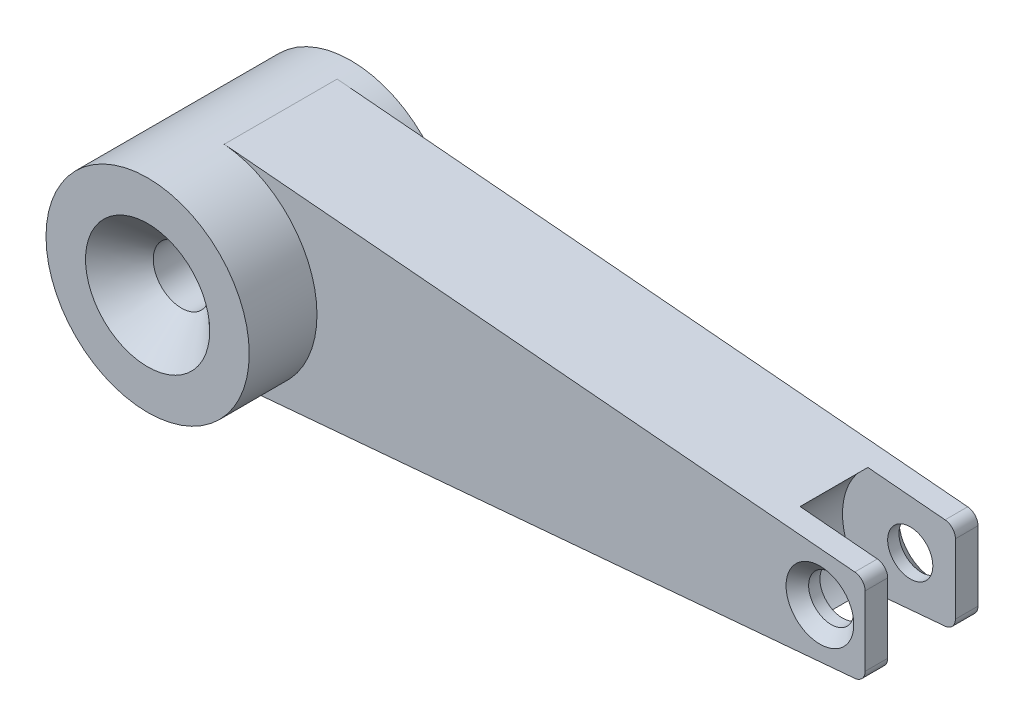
ISO-10303-21;
HEADER;
FILE_DESCRIPTION(('STEP AP214'),'2;1');
FILE_NAME('part.step','',(''),(''),'','','');
FILE_SCHEMA(('AUTOMOTIVE_DESIGN { 1 0 10303 214 1 1 1 1 }'));
ENDSEC;
DATA;
#1=APPLICATION_CONTEXT('core data for automotive mechanical design processes');
#2=APPLICATION_PROTOCOL_DEFINITION('international standard','automotive_design',2000,#1);
#3=PRODUCT_CONTEXT('',#1,'mechanical');
#4=PRODUCT('Part','Part','',(#3));
#5=PRODUCT_RELATED_PRODUCT_CATEGORY('part','',(#4));
#6=PRODUCT_DEFINITION_FORMATION('','',#4);
#7=PRODUCT_DEFINITION_CONTEXT('part definition',#1,'design');
#8=PRODUCT_DEFINITION('design','',#6,#7);
#9=PRODUCT_DEFINITION_SHAPE('','',#8);
#10=(LENGTH_UNIT() NAMED_UNIT(*) SI_UNIT(.MILLI.,.METRE.));
#11=(NAMED_UNIT(*) PLANE_ANGLE_UNIT() SI_UNIT($,.RADIAN.));
#12=(NAMED_UNIT(*) SI_UNIT($,.STERADIAN.) SOLID_ANGLE_UNIT());
#13=UNCERTAINTY_MEASURE_WITH_UNIT(LENGTH_MEASURE(1.E-05),#10,'distance_accuracy_value','');
#14=(GEOMETRIC_REPRESENTATION_CONTEXT(3) GLOBAL_UNCERTAINTY_ASSIGNED_CONTEXT((#13)) GLOBAL_UNIT_ASSIGNED_CONTEXT((#10,
#11,#12)) REPRESENTATION_CONTEXT('',''));
#15=CARTESIAN_POINT('',(0.,0.,0.));
#16=DIRECTION('',(0.,0.,1.));
#17=DIRECTION('',(1.,0.,0.));
#18=AXIS2_PLACEMENT_3D('',#15,#16,#17);
#19=CARTESIAN_POINT('',(57.5432099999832,4.,12.));
#20=DIRECTION('',(-1.,0.,0.));
#21=DIRECTION('',(0.,0.,1.));
#22=AXIS2_PLACEMENT_3D('',#19,#20,#21);
#23=PLANE('',#22);
#24=DIRECTION('',(0.,1.,0.));
#25=VECTOR('',#24,1.);
#26=CARTESIAN_POINT('',(57.5432099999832,4.,4.));
#27=LINE('',#26,#25);
#28=CARTESIAN_POINT('',(57.5432099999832,-3.08366882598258,4.));
#29=VERTEX_POINT('',#28);
#30=CARTESIAN_POINT('',(57.5432099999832,3.08366882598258,4.));
#31=VERTEX_POINT('',#30);
#32=EDGE_CURVE('E305',#29,#31,#27,.T.);
#33=ORIENTED_EDGE('',*,*,#32,.F.);
#34=DIRECTION('',(0.,0.,-1.));
#35=VECTOR('',#34,1.);
#36=CARTESIAN_POINT('',(57.5432099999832,-3.08366882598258,12.));
#37=LINE('',#36,#35);
#38=CARTESIAN_POINT('',(57.5432099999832,-3.08366882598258,2.));
#39=VERTEX_POINT('',#38);
#40=EDGE_CURVE('E175',#29,#39,#37,.T.);
#41=ORIENTED_EDGE('',*,*,#40,.T.);
#42=DIRECTION('',(0.,-1.,0.));
#43=VECTOR('',#42,1.);
#44=CARTESIAN_POINT('',(57.5432099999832,4.,2.));
#45=LINE('',#44,#43);
#46=CARTESIAN_POINT('',(57.5432099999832,3.08366882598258,2.));
#47=VERTEX_POINT('',#46);
#48=EDGE_CURVE('E271',#47,#39,#45,.T.);
#49=ORIENTED_EDGE('',*,*,#48,.F.);
#50=DIRECTION('',(0.,0.,-1.));
#51=VECTOR('',#50,1.);
#52=CARTESIAN_POINT('',(57.5432099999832,3.08366882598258,12.));
#53=LINE('',#52,#51);
#54=EDGE_CURVE('E173',#47,#31,#53,.F.);
#55=ORIENTED_EDGE('',*,*,#54,.T.);
#56=EDGE_LOOP('',(#33,#41,#49,#55));
#57=FACE_BOUND('',#56,.T.);
#58=ADVANCED_FACE('F35',(#57),#23,.F.);
#59=CARTESIAN_POINT('',(57.5432099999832,-4.,12.));
#60=DIRECTION('',(-0.0871557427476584,0.996194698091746,0.));
#61=DIRECTION('',(-0.996194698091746,-0.0871557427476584,0.));
#62=AXIS2_PLACEMENT_3D('',#59,#60,#61);
#63=PLANE('',#62);
#64=DIRECTION('',(-0.996194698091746,-0.0871557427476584,0.));
#65=VECTOR('',#64,1.);
#66=CARTESIAN_POINT('',(57.5432099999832,-4.,2.));
#67=LINE('',#66,#65);
#68=CARTESIAN_POINT('',(56.6303657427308,-4.07986352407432,2.));
#69=VERTEX_POINT('',#68);
#70=CARTESIAN_POINT('',(0.784401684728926,-8.96575228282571,2.));
#71=VERTEX_POINT('',#70);
#72=EDGE_CURVE('E274',#69,#71,#67,.T.);
#73=ORIENTED_EDGE('',*,*,#72,.F.);
#74=DIRECTION('',(0.,0.,-1.));
#75=VECTOR('',#74,1.);
#76=CARTESIAN_POINT('',(56.6303657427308,-4.07986352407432,12.));
#77=LINE('',#76,#75);
#78=CARTESIAN_POINT('',(56.6303657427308,-4.07986352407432,4.));
#79=VERTEX_POINT('',#78);
#80=EDGE_CURVE('E184',#69,#79,#77,.F.);
#81=ORIENTED_EDGE('',*,*,#80,.T.);
#82=DIRECTION('',(0.996194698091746,0.0871557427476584,0.));
#83=VECTOR('',#82,1.);
#84=CARTESIAN_POINT('',(57.5432099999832,-4.,4.));
#85=LINE('',#84,#83);
#86=CARTESIAN_POINT('',(49.7867873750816,-4.67859904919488,4.));
#87=VERTEX_POINT('',#86);
#88=EDGE_CURVE('E263',#87,#79,#85,.T.);
#89=ORIENTED_EDGE('',*,*,#88,.F.);
#90=DIRECTION('',(0.,0.,-1.));
#91=VECTOR('',#90,1.);
#92=CARTESIAN_POINT('',(49.7867873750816,-4.67859904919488,10.));
#93=LINE('',#92,#91);
#94=CARTESIAN_POINT('',(49.7867873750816,-4.67859904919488,10.));
#95=VERTEX_POINT('',#94);
#96=EDGE_CURVE('E149',#95,#87,#93,.T.);
#97=ORIENTED_EDGE('',*,*,#96,.F.);
#98=DIRECTION('',(0.996194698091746,0.0871557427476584,0.));
#99=VECTOR('',#98,1.);
#100=CARTESIAN_POINT('',(57.5432099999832,-4.,10.));
#101=LINE('',#100,#99);
#102=CARTESIAN_POINT('',(56.6303657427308,-4.07986352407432,10.));
#103=VERTEX_POINT('',#102);
#104=EDGE_CURVE('E256',#95,#103,#101,.T.);
#105=ORIENTED_EDGE('',*,*,#104,.T.);
#106=DIRECTION('',(0.,0.,-1.));
#107=VECTOR('',#106,1.);
#108=CARTESIAN_POINT('',(56.6303657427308,-4.07986352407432,12.));
#109=LINE('',#108,#107);
#110=CARTESIAN_POINT('',(56.6303657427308,-4.07986352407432,12.));
#111=VERTEX_POINT('',#110);
#112=EDGE_CURVE('E182',#103,#111,#109,.F.);
#113=ORIENTED_EDGE('',*,*,#112,.T.);
#114=DIRECTION('',(0.996194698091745,0.0871557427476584,0.));
#115=VECTOR('',#114,1.);
#116=CARTESIAN_POINT('',(57.5432099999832,-4.,12.));
#117=LINE('',#116,#115);
#118=CARTESIAN_POINT('',(0.784401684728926,-8.96575228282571,12.));
#119=VERTEX_POINT('',#118);
#120=EDGE_CURVE('E248',#119,#111,#117,.T.);
#121=ORIENTED_EDGE('',*,*,#120,.F.);
#122=DIRECTION('',(0.,0.,-1.));
#123=VECTOR('',#122,1.);
#124=CARTESIAN_POINT('',(0.784401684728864,-8.96575228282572,12.));
#125=LINE('',#124,#123);
#126=EDGE_CURVE('E281',#119,#71,#125,.T.);
#127=ORIENTED_EDGE('',*,*,#126,.T.);
#128=EDGE_LOOP('',(#73,#81,#89,#97,#105,#113,#121,#127));
#129=FACE_BOUND('',#128,.T.);
#130=ADVANCED_FACE('F227',(#129),#63,.F.);
#131=DIRECTION('',(0.,1.,0.));
#132=VECTOR('',#131,1.);
#133=CARTESIAN_POINT('',(57.5432099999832,4.,12.));
#134=LINE('',#133,#132);
#135=CARTESIAN_POINT('',(57.5432099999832,-3.08366882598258,12.));
#136=VERTEX_POINT('',#135);
#137=CARTESIAN_POINT('',(57.5432099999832,3.08366882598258,12.));
#138=VERTEX_POINT('',#137);
#139=EDGE_CURVE('E243',#136,#138,#134,.T.);
#140=ORIENTED_EDGE('',*,*,#139,.F.);
#141=DIRECTION('',(0.,0.,-1.));
#142=VECTOR('',#141,1.);
#143=CARTESIAN_POINT('',(57.5432099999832,-3.08366882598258,12.));
#144=LINE('',#143,#142);
#145=CARTESIAN_POINT('',(57.5432099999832,-3.08366882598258,10.));
#146=VERTEX_POINT('',#145);
#147=EDGE_CURVE('E194',#136,#146,#144,.T.);
#148=ORIENTED_EDGE('',*,*,#147,.T.);
#149=DIRECTION('',(0.,1.,0.));
#150=VECTOR('',#149,1.);
#151=CARTESIAN_POINT('',(57.5432099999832,4.,10.));
#152=LINE('',#151,#150);
#153=CARTESIAN_POINT('',(57.5432099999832,3.08366882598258,10.));
#154=VERTEX_POINT('',#153);
#155=EDGE_CURVE('E257',#146,#154,#152,.T.);
#156=ORIENTED_EDGE('',*,*,#155,.T.);
#157=DIRECTION('',(0.,0.,-1.));
#158=VECTOR('',#157,1.);
#159=CARTESIAN_POINT('',(57.5432099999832,3.08366882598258,12.));
#160=LINE('',#159,#158);
#161=EDGE_CURVE('E51',#154,#138,#160,.F.);
#162=ORIENTED_EDGE('',*,*,#161,.T.);
#163=EDGE_LOOP('',(#140,#148,#156,#162));
#164=FACE_BOUND('',#163,.T.);
#165=ADVANCED_FACE('F230',(#164),#23,.F.);
#166=CARTESIAN_POINT('',(0.784401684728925,8.96575228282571,12.));
#167=DIRECTION('',(-0.0871557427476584,-0.996194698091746,0.));
#168=DIRECTION('',(0.996194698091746,-0.0871557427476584,0.));
#169=AXIS2_PLACEMENT_3D('',#166,#167,#168);
#170=PLANE('',#169);
#171=DIRECTION('',(-0.996194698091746,0.0871557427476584,0.));
#172=VECTOR('',#171,1.);
#173=CARTESIAN_POINT('',(0.784401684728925,8.96575228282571,4.));
#174=LINE('',#173,#172);
#175=CARTESIAN_POINT('',(56.6303657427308,4.07986352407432,4.));
#176=VERTEX_POINT('',#175);
#177=CARTESIAN_POINT('',(49.7867873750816,4.67859904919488,4.));
#178=VERTEX_POINT('',#177);
#179=EDGE_CURVE('E127',#176,#178,#174,.T.);
#180=ORIENTED_EDGE('',*,*,#179,.F.);
#181=DIRECTION('',(0.,0.,-1.));
#182=VECTOR('',#181,1.);
#183=CARTESIAN_POINT('',(56.6303657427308,4.07986352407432,12.));
#184=LINE('',#183,#182);
#185=CARTESIAN_POINT('',(56.6303657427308,4.07986352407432,2.));
#186=VERTEX_POINT('',#185);
#187=EDGE_CURVE('E191',#176,#186,#184,.T.);
#188=ORIENTED_EDGE('',*,*,#187,.T.);
#189=DIRECTION('',(0.996194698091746,-0.0871557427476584,0.));
#190=VECTOR('',#189,1.);
#191=CARTESIAN_POINT('',(0.784401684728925,8.96575228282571,2.));
#192=LINE('',#191,#190);
#193=CARTESIAN_POINT('',(0.784401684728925,8.96575228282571,2.));
#194=VERTEX_POINT('',#193);
#195=EDGE_CURVE('E268',#194,#186,#192,.T.);
#196=ORIENTED_EDGE('',*,*,#195,.F.);
#197=DIRECTION('',(0.,0.,-1.));
#198=VECTOR('',#197,1.);
#199=CARTESIAN_POINT('',(0.784401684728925,8.96575228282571,12.));
#200=LINE('',#199,#198);
#201=CARTESIAN_POINT('',(0.784401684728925,8.96575228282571,12.));
#202=VERTEX_POINT('',#201);
#203=EDGE_CURVE('E278',#202,#194,#200,.T.);
#204=ORIENTED_EDGE('',*,*,#203,.F.);
#205=DIRECTION('',(-0.996194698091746,0.0871557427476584,0.));
#206=VECTOR('',#205,1.);
#207=CARTESIAN_POINT('',(0.784401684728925,8.96575228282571,12.));
#208=LINE('',#207,#206);
#209=CARTESIAN_POINT('',(56.6303657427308,4.07986352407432,12.));
#210=VERTEX_POINT('',#209);
#211=EDGE_CURVE('E247',#210,#202,#208,.T.);
#212=ORIENTED_EDGE('',*,*,#211,.F.);
#213=DIRECTION('',(0.,0.,-1.));
#214=VECTOR('',#213,1.);
#215=CARTESIAN_POINT('',(56.6303657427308,4.07986352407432,12.));
#216=LINE('',#215,#214);
#217=CARTESIAN_POINT('',(56.6303657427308,4.07986352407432,10.));
#218=VERTEX_POINT('',#217);
#219=EDGE_CURVE('E189',#210,#218,#216,.T.);
#220=ORIENTED_EDGE('',*,*,#219,.T.);
#221=DIRECTION('',(-0.996194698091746,0.0871557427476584,0.));
#222=VECTOR('',#221,1.);
#223=CARTESIAN_POINT('',(0.784401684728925,8.96575228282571,10.));
#224=LINE('',#223,#222);
#225=CARTESIAN_POINT('',(49.7867873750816,4.67859904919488,10.));
#226=VERTEX_POINT('',#225);
#227=EDGE_CURVE('E156',#218,#226,#224,.T.);
#228=ORIENTED_EDGE('',*,*,#227,.T.);
#229=DIRECTION('',(0.,0.,-1.));
#230=VECTOR('',#229,1.);
#231=CARTESIAN_POINT('',(49.7867873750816,4.67859904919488,10.));
#232=LINE('',#231,#230);
#233=EDGE_CURVE('E140',#178,#226,#232,.F.);
#234=ORIENTED_EDGE('',*,*,#233,.F.);
#235=EDGE_LOOP('',(#180,#188,#196,#204,#212,#220,#228,#234));
#236=FACE_BOUND('',#235,.T.);
#237=ADVANCED_FACE('F153',(#236),#170,.F.);
#238=CARTESIAN_POINT('',(0.,0.,18.));
#239=DIRECTION('',(0.,0.,-1.));
#240=DIRECTION('',(-1.,0.,0.));
#241=AXIS2_PLACEMENT_3D('',#238,#239,#240);
#242=CYLINDRICAL_SURFACE('',#241,9.);
#243=CARTESIAN_POINT('',(0.,0.,0.));
#244=DIRECTION('',(0.,0.,1.));
#245=DIRECTION('',(1.,0.,0.));
#246=AXIS2_PLACEMENT_3D('',#243,#244,#245);
#247=CIRCLE('',#246,9.);
#248=CARTESIAN_POINT('',(9.,0.,0.));
#249=VERTEX_POINT('',#248);
#250=EDGE_CURVE('E284',#249,#249,#247,.T.);
#251=ORIENTED_EDGE('',*,*,#250,.T.);
#252=EDGE_LOOP('',(#251));
#253=FACE_BOUND('',#252,.T.);
#254=CARTESIAN_POINT('',(0.,0.,18.));
#255=DIRECTION('',(0.,0.,1.));
#256=DIRECTION('',(1.,0.,0.));
#257=AXIS2_PLACEMENT_3D('',#254,#255,#256);
#258=CIRCLE('',#257,9.);
#259=CARTESIAN_POINT('',(9.,0.,18.));
#260=VERTEX_POINT('',#259);
#261=EDGE_CURVE('E285',#260,#260,#258,.T.);
#262=ORIENTED_EDGE('',*,*,#261,.F.);
#263=EDGE_LOOP('',(#262));
#264=FACE_BOUND('',#263,.T.);
#265=ORIENTED_EDGE('',*,*,#126,.F.);
#266=CARTESIAN_POINT('',(0.,0.,12.));
#267=DIRECTION('',(0.,0.,-1.));
#268=DIRECTION('',(-1.,0.,0.));
#269=AXIS2_PLACEMENT_3D('',#266,#267,#268);
#270=CIRCLE('',#269,9.);
#271=EDGE_CURVE('E141',#202,#119,#270,.T.);
#272=ORIENTED_EDGE('',*,*,#271,.F.);
#273=ORIENTED_EDGE('',*,*,#203,.T.);
#274=CARTESIAN_POINT('',(0.,0.,2.));
#275=DIRECTION('',(0.,0.,1.));
#276=DIRECTION('',(-1.,0.,0.));
#277=AXIS2_PLACEMENT_3D('',#274,#275,#276);
#278=CIRCLE('',#277,9.);
#279=EDGE_CURVE('E261',#71,#194,#278,.T.);
#280=ORIENTED_EDGE('',*,*,#279,.F.);
#281=EDGE_LOOP('',(#265,#272,#273,#280));
#282=FACE_BOUND('',#281,.T.);
#283=ADVANCED_FACE('F242',(#253,#264,#282),#242,.T.);
#284=CARTESIAN_POINT('',(0.,0.,18.));
#285=DIRECTION('',(0.,0.,1.));
#286=DIRECTION('',(1.,0.,0.));
#287=AXIS2_PLACEMENT_3D('',#284,#285,#286);
#288=PLANE('',#287);
#289=CARTESIAN_POINT('',(0.,0.,18.));
#290=DIRECTION('',(0.,0.,1.));
#291=DIRECTION('',(1.,0.,0.));
#292=AXIS2_PLACEMENT_3D('',#289,#290,#291);
#293=CIRCLE('',#292,5.50000000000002);
#294=CARTESIAN_POINT('',(5.50000000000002,0.,18.));
#295=VERTEX_POINT('',#294);
#296=EDGE_CURVE('E170',#295,#295,#293,.F.);
#297=ORIENTED_EDGE('',*,*,#296,.T.);
#298=EDGE_LOOP('',(#297));
#299=FACE_BOUND('',#298,.T.);
#300=ORIENTED_EDGE('',*,*,#261,.T.);
#301=EDGE_LOOP('',(#300));
#302=FACE_BOUND('',#301,.T.);
#303=ADVANCED_FACE('F345',(#299,#302),#288,.T.);
#304=CARTESIAN_POINT('',(0.,0.,0.));
#305=DIRECTION('',(0.,0.,1.));
#306=DIRECTION('',(1.,0.,0.));
#307=AXIS2_PLACEMENT_3D('',#304,#305,#306);
#308=PLANE('',#307);
#309=CARTESIAN_POINT('',(0.,0.,0.));
#310=DIRECTION('',(0.,0.,1.));
#311=DIRECTION('',(1.,0.,0.));
#312=AXIS2_PLACEMENT_3D('',#309,#310,#311);
#313=CIRCLE('',#312,5.50000000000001);
#314=CARTESIAN_POINT('',(5.50000000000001,0.,0.));
#315=VERTEX_POINT('',#314);
#316=EDGE_CURVE('E167',#315,#315,#313,.T.);
#317=ORIENTED_EDGE('',*,*,#316,.T.);
#318=EDGE_LOOP('',(#317));
#319=FACE_BOUND('',#318,.T.);
#320=ORIENTED_EDGE('',*,*,#250,.F.);
#321=EDGE_LOOP('',(#320));
#322=FACE_BOUND('',#321,.T.);
#323=ADVANCED_FACE('F340',(#319,#322),#308,.F.);
#324=CARTESIAN_POINT('',(0.,0.,12.));
#325=DIRECTION('',(0.,0.,-1.));
#326=DIRECTION('',(-1.,0.,0.));
#327=AXIS2_PLACEMENT_3D('',#324,#325,#326);
#328=PLANE('',#327);
#329=CARTESIAN_POINT('',(53.5432099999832,0.,12.));
#330=DIRECTION('',(0.,0.,-1.));
#331=DIRECTION('',(-1.,0.,0.));
#332=AXIS2_PLACEMENT_3D('',#329,#330,#331);
#333=CIRCLE('',#332,3.00000000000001);
#334=CARTESIAN_POINT('',(50.5432099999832,0.,12.));
#335=VERTEX_POINT('',#334);
#336=EDGE_CURVE('E11',#335,#335,#333,.T.);
#337=ORIENTED_EDGE('',*,*,#336,.T.);
#338=EDGE_LOOP('',(#337));
#339=FACE_BOUND('',#338,.T.);
#340=ORIENTED_EDGE('',*,*,#120,.T.);
#341=CARTESIAN_POINT('',(56.5432099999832,-3.08366882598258,12.));
#342=DIRECTION('',(0.,0.,-1.));
#343=DIRECTION('',(-1.,0.,0.));
#344=AXIS2_PLACEMENT_3D('',#341,#342,#343);
#345=CIRCLE('',#344,1.);
#346=EDGE_CURVE('E58',#111,#136,#345,.F.);
#347=ORIENTED_EDGE('',*,*,#346,.T.);
#348=ORIENTED_EDGE('',*,*,#139,.T.);
#349=CARTESIAN_POINT('',(56.5432099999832,3.08366882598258,12.));
#350=DIRECTION('',(0.,0.,-1.));
#351=DIRECTION('',(-1.,0.,0.));
#352=AXIS2_PLACEMENT_3D('',#349,#350,#351);
#353=CIRCLE('',#352,1.);
#354=EDGE_CURVE('E201',#138,#210,#353,.F.);
#355=ORIENTED_EDGE('',*,*,#354,.T.);
#356=ORIENTED_EDGE('',*,*,#211,.T.);
#357=ORIENTED_EDGE('',*,*,#271,.T.);
#358=EDGE_LOOP('',(#340,#347,#348,#355,#356,#357));
#359=FACE_BOUND('',#358,.T.);
#360=ADVANCED_FACE('F291',(#339,#359),#328,.F.);
#361=CARTESIAN_POINT('',(0.,0.,2.));
#362=DIRECTION('',(0.,0.,-1.));
#363=DIRECTION('',(-1.,0.,0.));
#364=AXIS2_PLACEMENT_3D('',#361,#362,#363);
#365=PLANE('',#364);
#366=CARTESIAN_POINT('',(53.5432099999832,0.,2.));
#367=DIRECTION('',(0.,0.,-1.));
#368=DIRECTION('',(-1.,0.,0.));
#369=AXIS2_PLACEMENT_3D('',#366,#367,#368);
#370=CIRCLE('',#369,3.);
#371=CARTESIAN_POINT('',(50.5432099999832,0.,2.));
#372=VERTEX_POINT('',#371);
#373=EDGE_CURVE('E210',#372,#372,#370,.F.);
#374=ORIENTED_EDGE('',*,*,#373,.T.);
#375=EDGE_LOOP('',(#374));
#376=FACE_BOUND('',#375,.T.);
#377=ORIENTED_EDGE('',*,*,#48,.T.);
#378=CARTESIAN_POINT('',(56.5432099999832,-3.08366882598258,2.));
#379=DIRECTION('',(0.,0.,-1.));
#380=DIRECTION('',(-1.,0.,0.));
#381=AXIS2_PLACEMENT_3D('',#378,#379,#380);
#382=CIRCLE('',#381,1.);
#383=EDGE_CURVE('E180',#39,#69,#382,.T.);
#384=ORIENTED_EDGE('',*,*,#383,.T.);
#385=ORIENTED_EDGE('',*,*,#72,.T.);
#386=ORIENTED_EDGE('',*,*,#279,.T.);
#387=ORIENTED_EDGE('',*,*,#195,.T.);
#388=CARTESIAN_POINT('',(56.5432099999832,3.08366882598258,2.));
#389=DIRECTION('',(0.,0.,-1.));
#390=DIRECTION('',(-1.,0.,0.));
#391=AXIS2_PLACEMENT_3D('',#388,#389,#390);
#392=CIRCLE('',#391,1.);
#393=EDGE_CURVE('E178',#186,#47,#392,.T.);
#394=ORIENTED_EDGE('',*,*,#393,.T.);
#395=EDGE_LOOP('',(#377,#384,#385,#386,#387,#394));
#396=FACE_BOUND('',#395,.T.);
#397=ADVANCED_FACE('F299',(#376,#396),#365,.T.);
#398=CARTESIAN_POINT('',(0.,0.,29.));
#399=DIRECTION('',(0.,0.,-1.));
#400=DIRECTION('',(-1.,0.,0.));
#401=AXIS2_PLACEMENT_3D('',#398,#399,#400);
#402=CYLINDRICAL_SURFACE('',#401,2.5);
#403=CARTESIAN_POINT('',(0.,0.,3.));
#404=DIRECTION('',(0.,0.,1.));
#405=DIRECTION('',(1.,0.,0.));
#406=AXIS2_PLACEMENT_3D('',#403,#404,#405);
#407=CIRCLE('',#406,2.5);
#408=CARTESIAN_POINT('',(2.5,0.,3.));
#409=VERTEX_POINT('',#408);
#410=EDGE_CURVE('E164',#409,#409,#407,.F.);
#411=ORIENTED_EDGE('',*,*,#410,.T.);
#412=EDGE_LOOP('',(#411));
#413=FACE_BOUND('',#412,.T.);
#414=CARTESIAN_POINT('',(0.,0.,15.));
#415=DIRECTION('',(0.,0.,1.));
#416=DIRECTION('',(1.,0.,0.));
#417=AXIS2_PLACEMENT_3D('',#414,#415,#416);
#418=CIRCLE('',#417,2.5);
#419=CARTESIAN_POINT('',(2.5,0.,15.));
#420=VERTEX_POINT('',#419);
#421=EDGE_CURVE('E158',#420,#420,#418,.T.);
#422=ORIENTED_EDGE('',*,*,#421,.T.);
#423=EDGE_LOOP('',(#422));
#424=FACE_BOUND('',#423,.T.);
#425=ADVANCED_FACE('F332',(#413,#424),#402,.F.);
#426=CARTESIAN_POINT('',(53.5432099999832,0.,10.));
#427=DIRECTION('',(0.,0.,-1.));
#428=DIRECTION('',(-1.,0.,0.));
#429=AXIS2_PLACEMENT_3D('',#426,#427,#428);
#430=CYLINDRICAL_SURFACE('',#429,6.);
#431=ORIENTED_EDGE('',*,*,#96,.T.);
#432=CARTESIAN_POINT('',(53.5432099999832,0.,4.));
#433=DIRECTION('',(0.,0.,1.));
#434=DIRECTION('',(1.,0.,0.));
#435=AXIS2_PLACEMENT_3D('',#432,#433,#434);
#436=CIRCLE('',#435,6.);
#437=EDGE_CURVE('E131',#178,#87,#436,.T.);
#438=ORIENTED_EDGE('',*,*,#437,.F.);
#439=ORIENTED_EDGE('',*,*,#233,.T.);
#440=CARTESIAN_POINT('',(53.5432099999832,0.,10.));
#441=DIRECTION('',(0.,0.,1.));
#442=DIRECTION('',(1.,0.,0.));
#443=AXIS2_PLACEMENT_3D('',#440,#441,#442);
#444=CIRCLE('',#443,6.);
#445=EDGE_CURVE('E150',#226,#95,#444,.T.);
#446=ORIENTED_EDGE('',*,*,#445,.T.);
#447=EDGE_LOOP('',(#431,#438,#439,#446));
#448=FACE_BOUND('',#447,.T.);
#449=ADVANCED_FACE('F145',(#448),#430,.F.);
#450=CARTESIAN_POINT('',(53.5432099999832,0.,10.));
#451=DIRECTION('',(0.,0.,1.));
#452=DIRECTION('',(1.,0.,0.));
#453=AXIS2_PLACEMENT_3D('',#450,#451,#452);
#454=PLANE('',#453);
#455=CARTESIAN_POINT('',(53.5432099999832,0.,10.));
#456=DIRECTION('',(0.,0.,1.));
#457=DIRECTION('',(1.,0.,0.));
#458=AXIS2_PLACEMENT_3D('',#455,#456,#457);
#459=CIRCLE('',#458,2.);
#460=CARTESIAN_POINT('',(55.5432099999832,0.,10.));
#461=VERTEX_POINT('',#460);
#462=EDGE_CURVE('E151',#461,#461,#459,.T.);
#463=ORIENTED_EDGE('',*,*,#462,.T.);
#464=EDGE_LOOP('',(#463));
#465=FACE_BOUND('',#464,.T.);
#466=ORIENTED_EDGE('',*,*,#155,.F.);
#467=CARTESIAN_POINT('',(56.5432099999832,-3.08366882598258,10.));
#468=DIRECTION('',(0.,0.,1.));
#469=DIRECTION('',(1.,0.,0.));
#470=AXIS2_PLACEMENT_3D('',#467,#468,#469);
#471=CIRCLE('',#470,1.);
#472=EDGE_CURVE('E199',#146,#103,#471,.F.);
#473=ORIENTED_EDGE('',*,*,#472,.T.);
#474=ORIENTED_EDGE('',*,*,#104,.F.);
#475=ORIENTED_EDGE('',*,*,#445,.F.);
#476=ORIENTED_EDGE('',*,*,#227,.F.);
#477=CARTESIAN_POINT('',(56.5432099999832,3.08366882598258,10.));
#478=DIRECTION('',(0.,0.,1.));
#479=DIRECTION('',(1.,0.,0.));
#480=AXIS2_PLACEMENT_3D('',#477,#478,#479);
#481=CIRCLE('',#480,1.);
#482=EDGE_CURVE('E197',#218,#154,#481,.F.);
#483=ORIENTED_EDGE('',*,*,#482,.T.);
#484=EDGE_LOOP('',(#466,#473,#474,#475,#476,#483));
#485=FACE_BOUND('',#484,.T.);
#486=ADVANCED_FACE('F255',(#465,#485),#454,.F.);
#487=CARTESIAN_POINT('',(53.5432099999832,0.,4.));
#488=DIRECTION('',(0.,0.,1.));
#489=DIRECTION('',(1.,0.,0.));
#490=AXIS2_PLACEMENT_3D('',#487,#488,#489);
#491=PLANE('',#490);
#492=CARTESIAN_POINT('',(53.5432099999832,0.,4.));
#493=DIRECTION('',(0.,0.,1.));
#494=DIRECTION('',(1.,0.,0.));
#495=AXIS2_PLACEMENT_3D('',#492,#493,#494);
#496=CIRCLE('',#495,2.);
#497=CARTESIAN_POINT('',(55.5432099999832,0.,4.));
#498=VERTEX_POINT('',#497);
#499=EDGE_CURVE('E205',#498,#498,#496,.T.);
#500=ORIENTED_EDGE('',*,*,#499,.F.);
#501=EDGE_LOOP('',(#500));
#502=FACE_BOUND('',#501,.T.);
#503=ORIENTED_EDGE('',*,*,#88,.T.);
#504=CARTESIAN_POINT('',(56.5432099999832,-3.08366882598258,4.));
#505=DIRECTION('',(0.,0.,1.));
#506=DIRECTION('',(1.,0.,0.));
#507=AXIS2_PLACEMENT_3D('',#504,#505,#506);
#508=CIRCLE('',#507,1.);
#509=EDGE_CURVE('E187',#79,#29,#508,.T.);
#510=ORIENTED_EDGE('',*,*,#509,.T.);
#511=ORIENTED_EDGE('',*,*,#32,.T.);
#512=CARTESIAN_POINT('',(56.5432099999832,3.08366882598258,4.));
#513=DIRECTION('',(0.,0.,1.));
#514=DIRECTION('',(1.,0.,0.));
#515=AXIS2_PLACEMENT_3D('',#512,#513,#514);
#516=CIRCLE('',#515,1.);
#517=EDGE_CURVE('E135',#31,#176,#516,.T.);
#518=ORIENTED_EDGE('',*,*,#517,.T.);
#519=ORIENTED_EDGE('',*,*,#179,.T.);
#520=ORIENTED_EDGE('',*,*,#437,.T.);
#521=EDGE_LOOP('',(#503,#510,#511,#518,#519,#520));
#522=FACE_BOUND('',#521,.T.);
#523=ADVANCED_FACE('F130',(#502,#522),#491,.T.);
#524=CARTESIAN_POINT('',(0.,0.,3.));
#525=DIRECTION('',(0.,0.,-1.));
#526=DIRECTION('',(-1.,0.,0.));
#527=AXIS2_PLACEMENT_3D('',#524,#525,#526);
#528=CONICAL_SURFACE('',#527,2.5,0.78539816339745);
#529=ORIENTED_EDGE('',*,*,#316,.F.);
#530=EDGE_LOOP('',(#529));
#531=FACE_BOUND('',#530,.T.);
#532=ORIENTED_EDGE('',*,*,#410,.F.);
#533=EDGE_LOOP('',(#532));
#534=FACE_BOUND('',#533,.T.);
#535=ADVANCED_FACE('F326',(#531,#534),#528,.F.);
#536=CARTESIAN_POINT('',(0.,0.,15.));
#537=DIRECTION('',(0.,0.,1.));
#538=DIRECTION('',(1.,0.,0.));
#539=AXIS2_PLACEMENT_3D('',#536,#537,#538);
#540=CONICAL_SURFACE('',#539,2.5,0.78539816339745);
#541=CARTESIAN_POINT('',(5.50000000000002,0.,18.));
#542=CARTESIAN_POINT('',(5.46875000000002,0.,17.96875));
#543=CARTESIAN_POINT('',(5.43750000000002,0.,17.9375));
#544=CARTESIAN_POINT('',(5.37500000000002,0.,17.875));
#545=CARTESIAN_POINT('',(5.34375000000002,0.,17.84375));
#546=CARTESIAN_POINT('',(5.28125000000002,0.,17.78125));
#547=CARTESIAN_POINT('',(5.25000000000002,0.,17.75));
#548=CARTESIAN_POINT('',(5.18750000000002,0.,17.6875));
#549=CARTESIAN_POINT('',(5.15625000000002,0.,17.65625));
#550=CARTESIAN_POINT('',(5.09375000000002,0.,17.59375));
#551=CARTESIAN_POINT('',(5.06250000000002,0.,17.5625));
#552=CARTESIAN_POINT('',(5.00000000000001,0.,17.5));
#553=CARTESIAN_POINT('',(4.96875000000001,0.,17.46875));
#554=CARTESIAN_POINT('',(4.90625000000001,0.,17.40625));
#555=CARTESIAN_POINT('',(4.87500000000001,0.,17.375));
#556=CARTESIAN_POINT('',(4.81250000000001,0.,17.3125));
#557=CARTESIAN_POINT('',(4.78125000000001,0.,17.28125));
#558=CARTESIAN_POINT('',(4.71875000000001,0.,17.21875));
#559=CARTESIAN_POINT('',(4.68750000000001,0.,17.1875));
#560=CARTESIAN_POINT('',(4.62500000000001,0.,17.125));
#561=CARTESIAN_POINT('',(4.59375000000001,0.,17.09375));
#562=CARTESIAN_POINT('',(4.53125000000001,0.,17.03125));
#563=CARTESIAN_POINT('',(4.50000000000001,0.,17.));
#564=CARTESIAN_POINT('',(4.43750000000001,0.,16.9375));
#565=CARTESIAN_POINT('',(4.40625000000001,0.,16.90625));
#566=CARTESIAN_POINT('',(4.34375000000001,0.,16.84375));
#567=CARTESIAN_POINT('',(4.31250000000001,0.,16.8125));
#568=CARTESIAN_POINT('',(4.25000000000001,0.,16.75));
#569=CARTESIAN_POINT('',(4.21875000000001,0.,16.71875));
#570=CARTESIAN_POINT('',(4.15625000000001,0.,16.65625));
#571=CARTESIAN_POINT('',(4.12500000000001,0.,16.625));
#572=CARTESIAN_POINT('',(4.06250000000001,0.,16.5625));
#573=CARTESIAN_POINT('',(4.03125000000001,0.,16.53125));
#574=CARTESIAN_POINT('',(3.96875000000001,0.,16.46875));
#575=CARTESIAN_POINT('',(3.93750000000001,0.,16.4375));
#576=CARTESIAN_POINT('',(3.87500000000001,0.,16.375));
#577=CARTESIAN_POINT('',(3.84375000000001,0.,16.34375));
#578=CARTESIAN_POINT('',(3.78125000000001,0.,16.28125));
#579=CARTESIAN_POINT('',(3.75000000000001,0.,16.25));
#580=CARTESIAN_POINT('',(3.68750000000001,0.,16.1875));
#581=CARTESIAN_POINT('',(3.65625000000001,0.,16.15625));
#582=CARTESIAN_POINT('',(3.59375000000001,0.,16.09375));
#583=CARTESIAN_POINT('',(3.56250000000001,0.,16.0625));
#584=CARTESIAN_POINT('',(3.50000000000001,0.,16.));
#585=CARTESIAN_POINT('',(3.46875000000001,0.,15.96875));
#586=CARTESIAN_POINT('',(3.40625,0.,15.90625));
#587=CARTESIAN_POINT('',(3.375,0.,15.875));
#588=CARTESIAN_POINT('',(3.3125,0.,15.8125));
#589=CARTESIAN_POINT('',(3.28125,0.,15.78125));
#590=CARTESIAN_POINT('',(3.21875,0.,15.71875));
#591=CARTESIAN_POINT('',(3.1875,0.,15.6875));
#592=CARTESIAN_POINT('',(3.125,0.,15.625));
#593=CARTESIAN_POINT('',(3.09375,0.,15.59375));
#594=CARTESIAN_POINT('',(3.03125,0.,15.53125));
#595=CARTESIAN_POINT('',(3.,0.,15.5));
#596=CARTESIAN_POINT('',(2.9375,0.,15.4375));
#597=CARTESIAN_POINT('',(2.90625,0.,15.40625));
#598=CARTESIAN_POINT('',(2.84375,0.,15.34375));
#599=CARTESIAN_POINT('',(2.8125,0.,15.3125));
#600=CARTESIAN_POINT('',(2.75,0.,15.25));
#601=CARTESIAN_POINT('',(2.71875,0.,15.21875));
#602=CARTESIAN_POINT('',(2.65625,0.,15.15625));
#603=CARTESIAN_POINT('',(2.625,0.,15.125));
#604=CARTESIAN_POINT('',(2.5625,0.,15.0625));
#605=CARTESIAN_POINT('',(2.53125,0.,15.03125));
#606=CARTESIAN_POINT('',(2.5,0.,15.));
#607=B_SPLINE_CURVE_WITH_KNOTS('',3,(#541,#542,#543,#544,#545,#546,#547,#548,#549,#550,#551,
#552,#553,#554,#555,#556,#557,#558,#559,#560,#561,#562,#563,#564,#565,#566,#567,#568,#569,#570,
#571,#572,#573,#574,#575,#576,#577,#578,#579,#580,#581,#582,#583,#584,#585,#586,#587,#588,#589,
#590,#591,#592,#593,#594,#595,#596,#597,#598,#599,#600,#601,#602,#603,#604,#605,#606),
.UNSPECIFIED.,.F.,.F.,(4,2,2,2,2,2,2,2,2,2,2,2,2,2,2,2,2,2,2,2,2,2,2,2,2,2,2,2,2,2,2,2,4),(0.,
0.132582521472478,0.265165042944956,0.397747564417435,0.530330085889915,0.66291260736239,
0.795495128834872,0.928077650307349,1.06066017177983,1.19324269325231,1.32582521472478,
1.45840773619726,1.59099025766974,1.72357277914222,1.8561553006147,1.98873782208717,
2.12132034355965,2.25390286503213,2.38648538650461,2.51906790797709,2.65165042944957,
2.78423295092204,2.91681547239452,3.049397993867,3.18198051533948,3.31456303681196,
3.44714555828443,3.57972807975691,3.71231060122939,3.84489312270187,3.97747564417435,
4.11005816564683,4.2426406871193),.UNSPECIFIED.);
#608=EDGE_CURVE('BSEAM364',#295,#420,#607,.T.);
#609=ORIENTED_EDGE('',*,*,#296,.F.);
#610=ORIENTED_EDGE('',*,*,#421,.F.);
#611=ORIENTED_EDGE('',*,*,#608,.T.);
#612=ORIENTED_EDGE('',*,*,#608,.F.);
#613=EDGE_LOOP('',(#609,#611,#610,#612));
#614=FACE_BOUND('',#613,.T.);
#615=ADVANCED_FACE('F364',(#614),#540,.F.);
#616=CARTESIAN_POINT('',(56.5432099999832,-3.08366882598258,12.));
#617=DIRECTION('',(0.,0.,-1.));
#618=DIRECTION('',(-1.,0.,0.));
#619=AXIS2_PLACEMENT_3D('',#616,#617,#618);
#620=CYLINDRICAL_SURFACE('',#619,1.);
#621=ORIENTED_EDGE('',*,*,#509,.F.);
#622=ORIENTED_EDGE('',*,*,#80,.F.);
#623=ORIENTED_EDGE('',*,*,#383,.F.);
#624=ORIENTED_EDGE('',*,*,#40,.F.);
#625=EDGE_LOOP('',(#621,#622,#623,#624));
#626=FACE_BOUND('',#625,.T.);
#627=ADVANCED_FACE('F308',(#626),#620,.T.);
#628=CARTESIAN_POINT('',(56.5432099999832,3.08366882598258,12.));
#629=DIRECTION('',(0.,0.,-1.));
#630=DIRECTION('',(-1.,0.,0.));
#631=AXIS2_PLACEMENT_3D('',#628,#629,#630);
#632=CYLINDRICAL_SURFACE('',#631,1.);
#633=ORIENTED_EDGE('',*,*,#517,.F.);
#634=ORIENTED_EDGE('',*,*,#54,.F.);
#635=ORIENTED_EDGE('',*,*,#393,.F.);
#636=ORIENTED_EDGE('',*,*,#187,.F.);
#637=EDGE_LOOP('',(#633,#634,#635,#636));
#638=FACE_BOUND('',#637,.T.);
#639=ADVANCED_FACE('F301',(#638),#632,.T.);
#640=CARTESIAN_POINT('',(56.5432099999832,-3.08366882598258,12.));
#641=DIRECTION('',(0.,0.,-1.));
#642=DIRECTION('',(-1.,0.,0.));
#643=AXIS2_PLACEMENT_3D('',#640,#641,#642);
#644=CYLINDRICAL_SURFACE('',#643,1.);
#645=ORIENTED_EDGE('',*,*,#346,.F.);
#646=ORIENTED_EDGE('',*,*,#112,.F.);
#647=ORIENTED_EDGE('',*,*,#472,.F.);
#648=ORIENTED_EDGE('',*,*,#147,.F.);
#649=EDGE_LOOP('',(#645,#646,#647,#648));
#650=FACE_BOUND('',#649,.T.);
#651=ADVANCED_FACE('F251',(#650),#644,.T.);
#652=CARTESIAN_POINT('',(56.5432099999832,3.08366882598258,12.));
#653=DIRECTION('',(0.,0.,-1.));
#654=DIRECTION('',(-1.,0.,0.));
#655=AXIS2_PLACEMENT_3D('',#652,#653,#654);
#656=CYLINDRICAL_SURFACE('',#655,1.);
#657=ORIENTED_EDGE('',*,*,#354,.F.);
#658=ORIENTED_EDGE('',*,*,#161,.F.);
#659=ORIENTED_EDGE('',*,*,#482,.F.);
#660=ORIENTED_EDGE('',*,*,#219,.F.);
#661=EDGE_LOOP('',(#657,#658,#659,#660));
#662=FACE_BOUND('',#661,.T.);
#663=ADVANCED_FACE('F321',(#662),#656,.T.);
#664=CARTESIAN_POINT('',(53.5432099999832,0.,-1.));
#665=DIRECTION('',(0.,0.,1.));
#666=DIRECTION('',(1.,0.,0.));
#667=AXIS2_PLACEMENT_3D('',#664,#665,#666);
#668=CYLINDRICAL_SURFACE('',#667,2.);
#669=CARTESIAN_POINT('',(53.5432099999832,0.,3.));
#670=DIRECTION('',(0.,0.,-1.));
#671=DIRECTION('',(-1.,0.,0.));
#672=AXIS2_PLACEMENT_3D('',#669,#670,#671);
#673=CIRCLE('',#672,2.);
#674=CARTESIAN_POINT('',(51.5432099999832,0.,3.));
#675=VERTEX_POINT('',#674);
#676=EDGE_CURVE('E204',#675,#675,#673,.T.);
#677=ORIENTED_EDGE('',*,*,#676,.T.);
#678=EDGE_LOOP('',(#677));
#679=FACE_BOUND('',#678,.T.);
#680=ORIENTED_EDGE('',*,*,#499,.T.);
#681=EDGE_LOOP('',(#680));
#682=FACE_BOUND('',#681,.T.);
#683=ADVANCED_FACE('F316',(#679,#682),#668,.F.);
#684=CARTESIAN_POINT('',(53.5432099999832,0.,11.));
#685=DIRECTION('',(0.,0.,-1.));
#686=DIRECTION('',(-1.,0.,0.));
#687=AXIS2_PLACEMENT_3D('',#684,#685,#686);
#688=CIRCLE('',#687,2.);
#689=CARTESIAN_POINT('',(51.5432099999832,0.,11.));
#690=VERTEX_POINT('',#689);
#691=EDGE_CURVE('E44',#690,#690,#688,.F.);
#692=ORIENTED_EDGE('',*,*,#691,.T.);
#693=EDGE_LOOP('',(#692));
#694=FACE_BOUND('',#693,.T.);
#695=ORIENTED_EDGE('',*,*,#462,.F.);
#696=EDGE_LOOP('',(#695));
#697=FACE_BOUND('',#696,.T.);
#698=ADVANCED_FACE('F215',(#694,#697),#668,.F.);
#699=CARTESIAN_POINT('',(53.5432099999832,0.,3.));
#700=DIRECTION('',(0.,0.,-1.));
#701=DIRECTION('',(-1.,0.,0.));
#702=AXIS2_PLACEMENT_3D('',#699,#700,#701);
#703=CONICAL_SURFACE('',#702,2.,0.785398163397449);
#704=ORIENTED_EDGE('',*,*,#373,.F.);
#705=EDGE_LOOP('',(#704));
#706=FACE_BOUND('',#705,.T.);
#707=ORIENTED_EDGE('',*,*,#676,.F.);
#708=EDGE_LOOP('',(#707));
#709=FACE_BOUND('',#708,.T.);
#710=ADVANCED_FACE('F219',(#706,#709),#703,.F.);
#711=CARTESIAN_POINT('',(53.5432099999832,0.,11.));
#712=DIRECTION('',(0.,0.,1.));
#713=DIRECTION('',(1.,0.,0.));
#714=AXIS2_PLACEMENT_3D('',#711,#712,#713);
#715=CONICAL_SURFACE('',#714,2.,0.785398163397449);
#716=ORIENTED_EDGE('',*,*,#336,.F.);
#717=EDGE_LOOP('',(#716));
#718=FACE_BOUND('',#717,.T.);
#719=ORIENTED_EDGE('',*,*,#691,.F.);
#720=EDGE_LOOP('',(#719));
#721=FACE_BOUND('',#720,.T.);
#722=ADVANCED_FACE('F38',(#718,#721),#715,.F.);
#723=CLOSED_SHELL('',(#58,#130,#165,#237,#283,#303,#323,#360,#397,#425,#449,#486,#523,#535,#615,
#627,#639,#651,#663,#683,#698,#710,#722));
#724=MANIFOLD_SOLID_BREP('B2',#723);
#725=ADVANCED_BREP_SHAPE_REPRESENTATION('',(#18,#724),#14);
#726=SHAPE_DEFINITION_REPRESENTATION(#9,#725);
ENDSEC;
END-ISO-10303-21;
